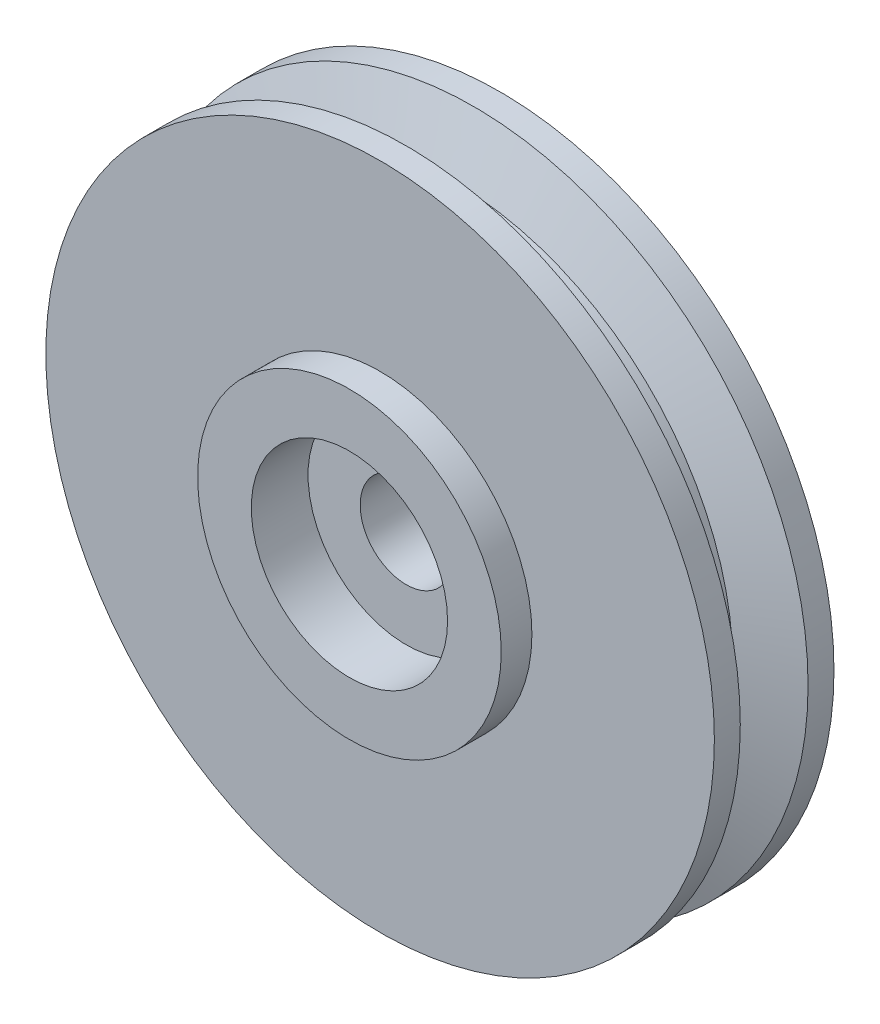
ISO-10303-21;
HEADER;
FILE_DESCRIPTION(('STEP AP214'),'2;1');
FILE_NAME('part.step','',(''),(''),'','','');
FILE_SCHEMA(('AUTOMOTIVE_DESIGN { 1 0 10303 214 1 1 1 1 }'));
ENDSEC;
DATA;
#1=APPLICATION_CONTEXT('core data for automotive mechanical design processes');
#2=APPLICATION_PROTOCOL_DEFINITION('international standard','automotive_design',2000,#1);
#3=PRODUCT_CONTEXT('',#1,'mechanical');
#4=PRODUCT('Part','Part','',(#3));
#5=PRODUCT_RELATED_PRODUCT_CATEGORY('part','',(#4));
#6=PRODUCT_DEFINITION_FORMATION('','',#4);
#7=PRODUCT_DEFINITION_CONTEXT('part definition',#1,'design');
#8=PRODUCT_DEFINITION('design','',#6,#7);
#9=PRODUCT_DEFINITION_SHAPE('','',#8);
#10=(LENGTH_UNIT() NAMED_UNIT(*) SI_UNIT(.MILLI.,.METRE.));
#11=(NAMED_UNIT(*) PLANE_ANGLE_UNIT() SI_UNIT($,.RADIAN.));
#12=(NAMED_UNIT(*) SI_UNIT($,.STERADIAN.) SOLID_ANGLE_UNIT());
#13=UNCERTAINTY_MEASURE_WITH_UNIT(LENGTH_MEASURE(1.E-05),#10,'distance_accuracy_value','');
#14=(GEOMETRIC_REPRESENTATION_CONTEXT(3) GLOBAL_UNCERTAINTY_ASSIGNED_CONTEXT((#13)) GLOBAL_UNIT_ASSIGNED_CONTEXT((#10,
#11,#12)) REPRESENTATION_CONTEXT('',''));
#15=CARTESIAN_POINT('',(0.,0.,0.));
#16=DIRECTION('',(0.,0.,1.));
#17=DIRECTION('',(1.,0.,0.));
#18=AXIS2_PLACEMENT_3D('',#15,#16,#17);
#19=CARTESIAN_POINT('',(0.,0.,40.));
#20=DIRECTION('',(0.,0.,1.));
#21=DIRECTION('',(1.,0.,0.));
#22=AXIS2_PLACEMENT_3D('',#19,#20,#21);
#23=CYLINDRICAL_SURFACE('',#22,24.75);
#24=CARTESIAN_POINT('',(0.,0.,14.75));
#25=DIRECTION('',(0.,0.,1.));
#26=DIRECTION('',(1.,0.,0.));
#27=AXIS2_PLACEMENT_3D('',#24,#25,#26);
#28=CIRCLE('',#27,24.75);
#29=CARTESIAN_POINT('',(24.75,0.,14.75));
#30=VERTEX_POINT('',#29);
#31=EDGE_CURVE('E58',#30,#30,#28,.T.);
#32=ORIENTED_EDGE('',*,*,#31,.F.);
#33=EDGE_LOOP('',(#32));
#34=FACE_BOUND('',#33,.T.);
#35=CARTESIAN_POINT('',(0.,0.,9.75));
#36=DIRECTION('',(0.,0.,1.));
#37=DIRECTION('',(1.,0.,0.));
#38=AXIS2_PLACEMENT_3D('',#35,#36,#37);
#39=CIRCLE('',#38,24.75);
#40=CARTESIAN_POINT('',(24.75,0.,9.75));
#41=VERTEX_POINT('',#40);
#42=EDGE_CURVE('E8',#41,#41,#39,.T.);
#43=ORIENTED_EDGE('',*,*,#42,.T.);
#44=EDGE_LOOP('',(#43));
#45=FACE_BOUND('',#44,.T.);
#46=ADVANCED_FACE('F12',(#34,#45),#23,.T.);
#47=CARTESIAN_POINT('',(0.,24.75,9.75));
#48=DIRECTION('',(0.,0.,1.));
#49=DIRECTION('',(1.,0.,0.));
#50=AXIS2_PLACEMENT_3D('',#47,#48,#49);
#51=PLANE('',#50);
#52=CARTESIAN_POINT('',(0.,0.,9.75));
#53=DIRECTION('',(0.,0.,1.));
#54=DIRECTION('',(1.,0.,0.));
#55=AXIS2_PLACEMENT_3D('',#52,#53,#54);
#56=CIRCLE('',#55,54.5);
#57=CARTESIAN_POINT('',(54.5,0.,9.75));
#58=VERTEX_POINT('',#57);
#59=EDGE_CURVE('E18',#58,#58,#56,.T.);
#60=ORIENTED_EDGE('',*,*,#59,.T.);
#61=EDGE_LOOP('',(#60));
#62=FACE_BOUND('',#61,.T.);
#63=ORIENTED_EDGE('',*,*,#42,.F.);
#64=EDGE_LOOP('',(#63));
#65=FACE_BOUND('',#64,.T.);
#66=ADVANCED_FACE('F65',(#62,#65),#51,.T.);
#67=CARTESIAN_POINT('',(0.,0.,40.));
#68=DIRECTION('',(0.,0.,1.));
#69=DIRECTION('',(1.,0.,0.));
#70=AXIS2_PLACEMENT_3D('',#67,#68,#69);
#71=CYLINDRICAL_SURFACE('',#70,54.5);
#72=CARTESIAN_POINT('',(0.,0.,5.52573210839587));
#73=DIRECTION('',(0.,0.,1.));
#74=DIRECTION('',(1.,0.,0.));
#75=AXIS2_PLACEMENT_3D('',#72,#73,#74);
#76=CIRCLE('',#75,54.5);
#77=CARTESIAN_POINT('',(54.5,0.,5.52573210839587));
#78=VERTEX_POINT('',#77);
#79=EDGE_CURVE('E22',#78,#78,#76,.T.);
#80=ORIENTED_EDGE('',*,*,#79,.T.);
#81=EDGE_LOOP('',(#80));
#82=FACE_BOUND('',#81,.T.);
#83=ORIENTED_EDGE('',*,*,#59,.F.);
#84=EDGE_LOOP('',(#83));
#85=FACE_BOUND('',#84,.T.);
#86=ADVANCED_FACE('F70',(#82,#85),#71,.T.);
#87=CARTESIAN_POINT('',(0.,0.,2.25));
#88=DIRECTION('',(0.,0.,1.));
#89=DIRECTION('',(1.,0.,0.));
#90=AXIS2_PLACEMENT_3D('',#87,#88,#89);
#91=CONICAL_SURFACE('',#90,45.5,1.22173047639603);
#92=ORIENTED_EDGE('',*,*,#79,.F.);
#93=EDGE_LOOP('',(#92));
#94=FACE_BOUND('',#93,.T.);
#95=CARTESIAN_POINT('',(0.,0.,2.25));
#96=DIRECTION('',(0.,0.,1.));
#97=DIRECTION('',(1.,0.,0.));
#98=AXIS2_PLACEMENT_3D('',#95,#96,#97);
#99=CIRCLE('',#98,45.5);
#100=CARTESIAN_POINT('',(45.5,0.,2.25));
#101=VERTEX_POINT('',#100);
#102=EDGE_CURVE('E26',#101,#101,#99,.T.);
#103=ORIENTED_EDGE('',*,*,#102,.T.);
#104=EDGE_LOOP('',(#103));
#105=FACE_BOUND('',#104,.T.);
#106=ADVANCED_FACE('F74',(#94,#105),#91,.T.);
#107=CARTESIAN_POINT('',(0.,0.,40.));
#108=DIRECTION('',(0.,0.,1.));
#109=DIRECTION('',(1.,0.,0.));
#110=AXIS2_PLACEMENT_3D('',#107,#108,#109);
#111=CYLINDRICAL_SURFACE('',#110,45.5);
#112=ORIENTED_EDGE('',*,*,#102,.F.);
#113=EDGE_LOOP('',(#112));
#114=FACE_BOUND('',#113,.T.);
#115=CARTESIAN_POINT('',(0.,0.,-2.25));
#116=DIRECTION('',(0.,0.,1.));
#117=DIRECTION('',(1.,0.,0.));
#118=AXIS2_PLACEMENT_3D('',#115,#116,#117);
#119=CIRCLE('',#118,45.5);
#120=CARTESIAN_POINT('',(45.5,0.,-2.25));
#121=VERTEX_POINT('',#120);
#122=EDGE_CURVE('E31',#121,#121,#119,.T.);
#123=ORIENTED_EDGE('',*,*,#122,.T.);
#124=EDGE_LOOP('',(#123));
#125=FACE_BOUND('',#124,.T.);
#126=ADVANCED_FACE('F81',(#114,#125),#111,.T.);
#127=CARTESIAN_POINT('',(0.,0.,-2.25));
#128=DIRECTION('',(0.,0.,-1.));
#129=DIRECTION('',(-1.,0.,0.));
#130=AXIS2_PLACEMENT_3D('',#127,#128,#129);
#131=CONICAL_SURFACE('',#130,45.5,1.22173047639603);
#132=CARTESIAN_POINT('',(0.,0.,-5.52573210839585));
#133=DIRECTION('',(0.,0.,1.));
#134=DIRECTION('',(1.,0.,0.));
#135=AXIS2_PLACEMENT_3D('',#132,#133,#134);
#136=CIRCLE('',#135,54.5);
#137=CARTESIAN_POINT('',(54.5,0.,-5.52573210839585));
#138=VERTEX_POINT('',#137);
#139=EDGE_CURVE('E34',#138,#138,#136,.T.);
#140=ORIENTED_EDGE('',*,*,#139,.T.);
#141=EDGE_LOOP('',(#140));
#142=FACE_BOUND('',#141,.T.);
#143=ORIENTED_EDGE('',*,*,#122,.F.);
#144=EDGE_LOOP('',(#143));
#145=FACE_BOUND('',#144,.T.);
#146=ADVANCED_FACE('F85',(#142,#145),#131,.T.);
#147=CARTESIAN_POINT('',(0.,0.,40.));
#148=DIRECTION('',(0.,0.,1.));
#149=DIRECTION('',(1.,0.,0.));
#150=AXIS2_PLACEMENT_3D('',#147,#148,#149);
#151=CYLINDRICAL_SURFACE('',#150,54.5);
#152=ORIENTED_EDGE('',*,*,#139,.F.);
#153=EDGE_LOOP('',(#152));
#154=FACE_BOUND('',#153,.T.);
#155=CARTESIAN_POINT('',(0.,0.,-9.75));
#156=DIRECTION('',(0.,0.,1.));
#157=DIRECTION('',(1.,0.,0.));
#158=AXIS2_PLACEMENT_3D('',#155,#156,#157);
#159=CIRCLE('',#158,54.5);
#160=CARTESIAN_POINT('',(54.5,0.,-9.75));
#161=VERTEX_POINT('',#160);
#162=EDGE_CURVE('E37',#161,#161,#159,.T.);
#163=ORIENTED_EDGE('',*,*,#162,.T.);
#164=EDGE_LOOP('',(#163));
#165=FACE_BOUND('',#164,.T.);
#166=ADVANCED_FACE('F89',(#154,#165),#151,.T.);
#167=CARTESIAN_POINT('',(0.,16.,-9.75));
#168=DIRECTION('',(0.,0.,1.));
#169=DIRECTION('',(1.,0.,0.));
#170=AXIS2_PLACEMENT_3D('',#167,#168,#169);
#171=PLANE('',#170);
#172=ORIENTED_EDGE('',*,*,#162,.F.);
#173=EDGE_LOOP('',(#172));
#174=FACE_BOUND('',#173,.T.);
#175=CARTESIAN_POINT('',(0.,0.,-9.75));
#176=DIRECTION('',(0.,0.,1.));
#177=DIRECTION('',(1.,0.,0.));
#178=AXIS2_PLACEMENT_3D('',#175,#176,#177);
#179=CIRCLE('',#178,16.);
#180=CARTESIAN_POINT('',(16.,0.,-9.75));
#181=VERTEX_POINT('',#180);
#182=EDGE_CURVE('E40',#181,#181,#179,.T.);
#183=ORIENTED_EDGE('',*,*,#182,.T.);
#184=EDGE_LOOP('',(#183));
#185=FACE_BOUND('',#184,.T.);
#186=ADVANCED_FACE('F93',(#174,#185),#171,.F.);
#187=CARTESIAN_POINT('',(0.,0.,40.));
#188=DIRECTION('',(0.,0.,1.));
#189=DIRECTION('',(1.,0.,0.));
#190=AXIS2_PLACEMENT_3D('',#187,#188,#189);
#191=CYLINDRICAL_SURFACE('',#190,16.);
#192=ORIENTED_EDGE('',*,*,#182,.F.);
#193=EDGE_LOOP('',(#192));
#194=FACE_BOUND('',#193,.T.);
#195=CARTESIAN_POINT('',(0.,0.,-5.5));
#196=DIRECTION('',(0.,0.,1.));
#197=DIRECTION('',(1.,0.,0.));
#198=AXIS2_PLACEMENT_3D('',#195,#196,#197);
#199=CIRCLE('',#198,16.);
#200=CARTESIAN_POINT('',(16.,0.,-5.5));
#201=VERTEX_POINT('',#200);
#202=EDGE_CURVE('E43',#201,#201,#199,.T.);
#203=ORIENTED_EDGE('',*,*,#202,.T.);
#204=EDGE_LOOP('',(#203));
#205=FACE_BOUND('',#204,.T.);
#206=ADVANCED_FACE('F97',(#194,#205),#191,.F.);
#207=CARTESIAN_POINT('',(0.,7.5,-5.5));
#208=DIRECTION('',(0.,0.,1.));
#209=DIRECTION('',(1.,0.,0.));
#210=AXIS2_PLACEMENT_3D('',#207,#208,#209);
#211=PLANE('',#210);
#212=ORIENTED_EDGE('',*,*,#202,.F.);
#213=EDGE_LOOP('',(#212));
#214=FACE_BOUND('',#213,.T.);
#215=CARTESIAN_POINT('',(0.,0.,-5.5));
#216=DIRECTION('',(0.,0.,1.));
#217=DIRECTION('',(1.,0.,0.));
#218=AXIS2_PLACEMENT_3D('',#215,#216,#217);
#219=CIRCLE('',#218,7.5);
#220=CARTESIAN_POINT('',(7.5,0.,-5.5));
#221=VERTEX_POINT('',#220);
#222=EDGE_CURVE('E46',#221,#221,#219,.T.);
#223=ORIENTED_EDGE('',*,*,#222,.T.);
#224=EDGE_LOOP('',(#223));
#225=FACE_BOUND('',#224,.T.);
#226=ADVANCED_FACE('F101',(#214,#225),#211,.F.);
#227=CARTESIAN_POINT('',(0.,0.,40.));
#228=DIRECTION('',(0.,0.,1.));
#229=DIRECTION('',(1.,0.,0.));
#230=AXIS2_PLACEMENT_3D('',#227,#228,#229);
#231=CYLINDRICAL_SURFACE('',#230,7.5);
#232=ORIENTED_EDGE('',*,*,#222,.F.);
#233=EDGE_LOOP('',(#232));
#234=FACE_BOUND('',#233,.T.);
#235=CARTESIAN_POINT('',(0.,0.,5.5));
#236=DIRECTION('',(0.,0.,1.));
#237=DIRECTION('',(1.,0.,0.));
#238=AXIS2_PLACEMENT_3D('',#235,#236,#237);
#239=CIRCLE('',#238,7.5);
#240=CARTESIAN_POINT('',(7.5,0.,5.5));
#241=VERTEX_POINT('',#240);
#242=EDGE_CURVE('E49',#241,#241,#239,.T.);
#243=ORIENTED_EDGE('',*,*,#242,.T.);
#244=EDGE_LOOP('',(#243));
#245=FACE_BOUND('',#244,.T.);
#246=ADVANCED_FACE('F105',(#234,#245),#231,.F.);
#247=CARTESIAN_POINT('',(0.,7.5,5.5));
#248=DIRECTION('',(0.,0.,1.));
#249=DIRECTION('',(1.,0.,0.));
#250=AXIS2_PLACEMENT_3D('',#247,#248,#249);
#251=PLANE('',#250);
#252=CARTESIAN_POINT('',(0.,0.,5.5));
#253=DIRECTION('',(0.,0.,1.));
#254=DIRECTION('',(1.,0.,0.));
#255=AXIS2_PLACEMENT_3D('',#252,#253,#254);
#256=CIRCLE('',#255,16.);
#257=CARTESIAN_POINT('',(16.,0.,5.5));
#258=VERTEX_POINT('',#257);
#259=EDGE_CURVE('E52',#258,#258,#256,.T.);
#260=ORIENTED_EDGE('',*,*,#259,.T.);
#261=EDGE_LOOP('',(#260));
#262=FACE_BOUND('',#261,.T.);
#263=ORIENTED_EDGE('',*,*,#242,.F.);
#264=EDGE_LOOP('',(#263));
#265=FACE_BOUND('',#264,.T.);
#266=ADVANCED_FACE('F109',(#262,#265),#251,.T.);
#267=CARTESIAN_POINT('',(0.,0.,40.));
#268=DIRECTION('',(0.,0.,1.));
#269=DIRECTION('',(1.,0.,0.));
#270=AXIS2_PLACEMENT_3D('',#267,#268,#269);
#271=CYLINDRICAL_SURFACE('',#270,16.);
#272=CARTESIAN_POINT('',(0.,0.,14.75));
#273=DIRECTION('',(0.,0.,1.));
#274=DIRECTION('',(1.,0.,0.));
#275=AXIS2_PLACEMENT_3D('',#272,#273,#274);
#276=CIRCLE('',#275,16.);
#277=CARTESIAN_POINT('',(16.,0.,14.75));
#278=VERTEX_POINT('',#277);
#279=EDGE_CURVE('E55',#278,#278,#276,.T.);
#280=ORIENTED_EDGE('',*,*,#279,.T.);
#281=EDGE_LOOP('',(#280));
#282=FACE_BOUND('',#281,.T.);
#283=ORIENTED_EDGE('',*,*,#259,.F.);
#284=EDGE_LOOP('',(#283));
#285=FACE_BOUND('',#284,.T.);
#286=ADVANCED_FACE('F113',(#282,#285),#271,.F.);
#287=CARTESIAN_POINT('',(0.,24.75,14.75));
#288=DIRECTION('',(0.,0.,-1.));
#289=DIRECTION('',(-1.,0.,0.));
#290=AXIS2_PLACEMENT_3D('',#287,#288,#289);
#291=PLANE('',#290);
#292=ORIENTED_EDGE('',*,*,#279,.F.);
#293=EDGE_LOOP('',(#292));
#294=FACE_BOUND('',#293,.T.);
#295=ORIENTED_EDGE('',*,*,#31,.T.);
#296=EDGE_LOOP('',(#295));
#297=FACE_BOUND('',#296,.T.);
#298=ADVANCED_FACE('F62',(#294,#297),#291,.F.);
#299=CLOSED_SHELL('',(#46,#66,#86,#106,#126,#146,#166,#186,#206,#226,#246,#266,#286,#298));
#300=MANIFOLD_SOLID_BREP('B1',#299);
#301=ADVANCED_BREP_SHAPE_REPRESENTATION('',(#18,#300),#14);
#302=SHAPE_DEFINITION_REPRESENTATION(#9,#301);
ENDSEC;
END-ISO-10303-21;
